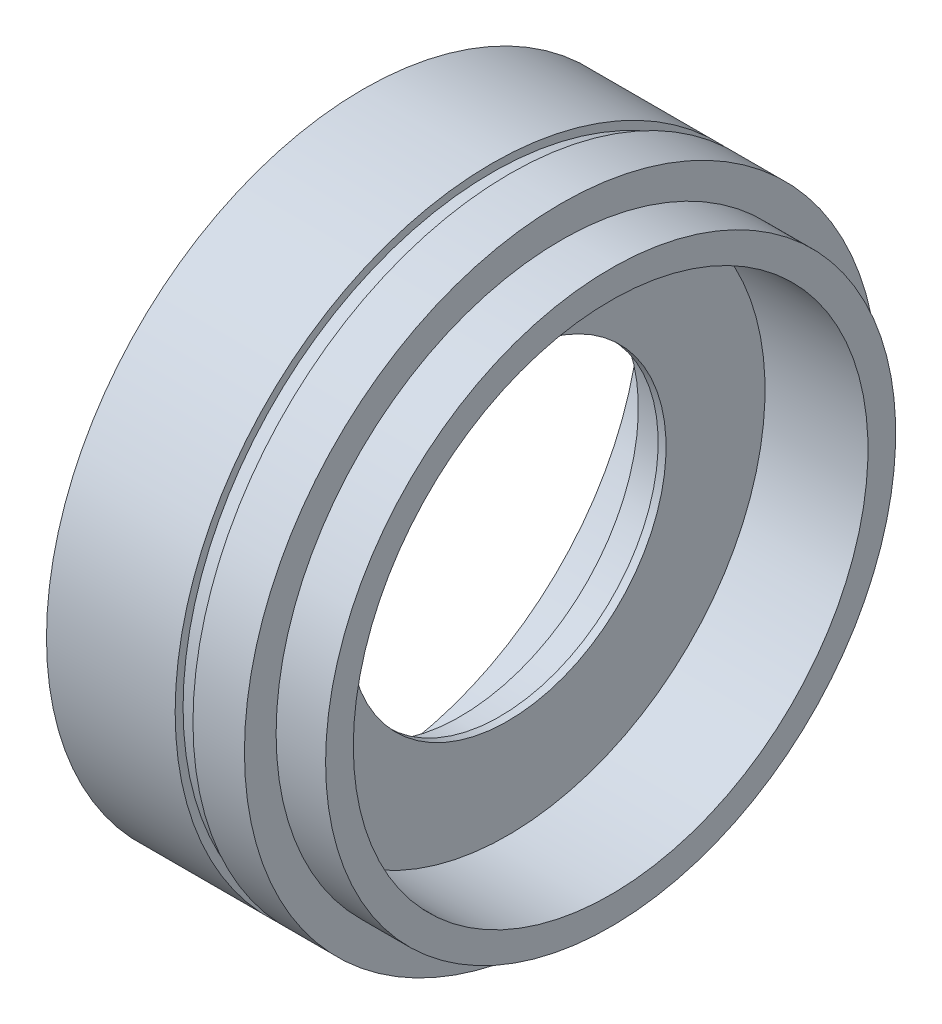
from build123d import *

# Parameters (mm, degrees)
R_P_TITION_CIRCULAIRE1_COUNT = 4
ESQUISSE5_W                  = 4.5
ESQUISSE5_H                  = 2


with BuildPart() as part:
    # Esquisse1 → R_volution1 (revolve)
    with BuildSketch(Plane.XY, mode=Mode.PRIVATE) as r_volution1_sk:
        Polygon((0, 80), (50, 80), (50, 72), (62.5, 72), (62.5, 65), (36.5, 65), (36.5, 40), (34.5, 40), (34.5, 45), (24.5, 45), (24.5, 70), (0, 70), align=None)
    revolve(r_volution1_sk.sketch.rotate(Axis((0, 0, 0), (1, 0, 0)), 90), axis=Axis((0, 0, 0), (1, 0, 0)))

    # Esquisse2 → D_gagement M61 (revolve, cut)
    with BuildSketch(Plane.ZX.offset(75)):
        Polygon((0, 0), (0, 11.982840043), (3.3, 10), (3.3, 0), align=None)
    d_gagement_m61 = revolve(axis=Axis((-6.35, 75, 0), (1, 0, 0)), mode=Mode.SUBTRACT)

    # R_p_tition circulaire1: D_gagement M61 ×4 about axis
    r_p_tition_circulaire1_axis = Axis((0, 0, 0), (1, 0, 0))
    for i in range(1, R_P_TITION_CIRCULAIRE1_COUNT):
        add(d_gagement_m61.rotate(r_p_tition_circulaire1_axis, i * 360 / R_P_TITION_CIRCULAIRE1_COUNT), mode=Mode.SUBTRACT)

    # Esquisse5 → Enl_vement de mati_re-R_volution1 (revolve, cut)
    with BuildSketch(Plane.XY, mode=Mode.PRIVATE) as enl_vement_de_mati_re_r_volution1_sk:
        with Locations((34.75, 79)):
            Rectangle(ESQUISSE5_W, ESQUISSE5_H)
    revolve(enl_vement_de_mati_re_r_volution1_sk.sketch.rotate(Axis((0, 0, 0), (1, 0, 0)), 90), axis=Axis((0, 0, 0), (1, 0, 0)), mode=Mode.SUBTRACT)


solid = part.part
